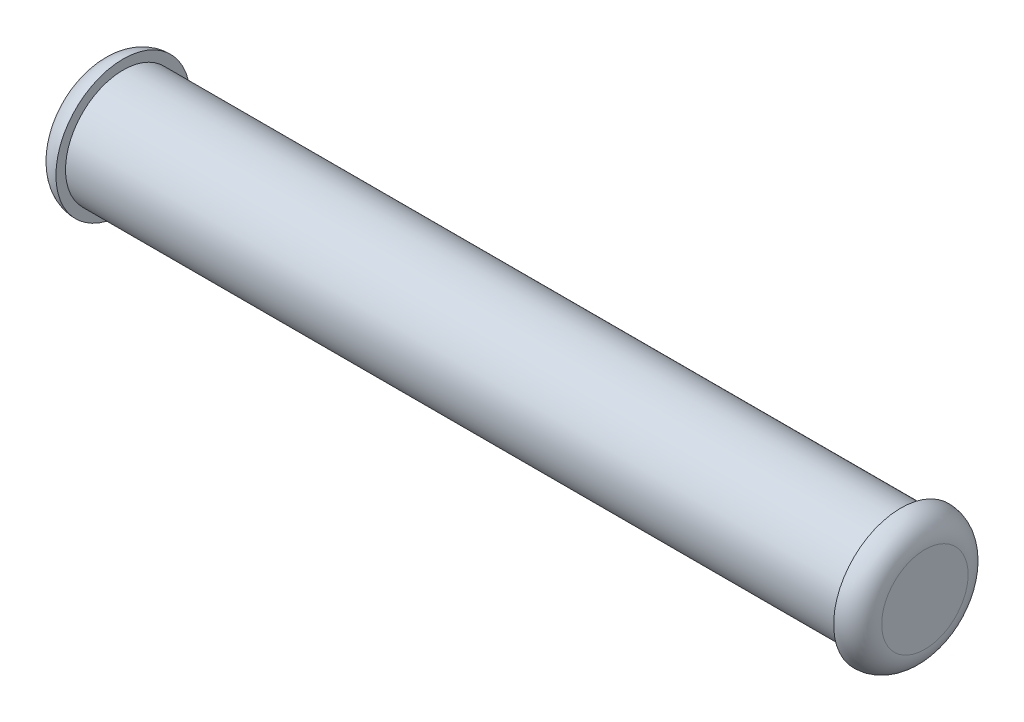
ISO-10303-21;
HEADER;
FILE_DESCRIPTION(('STEP AP214'),'2;1');
FILE_NAME('part.step','',(''),(''),'','','');
FILE_SCHEMA(('AUTOMOTIVE_DESIGN { 1 0 10303 214 1 1 1 1 }'));
ENDSEC;
DATA;
#1=APPLICATION_CONTEXT('core data for automotive mechanical design processes');
#2=APPLICATION_PROTOCOL_DEFINITION('international standard','automotive_design',2000,#1);
#3=PRODUCT_CONTEXT('',#1,'mechanical');
#4=PRODUCT('Part','Part','',(#3));
#5=PRODUCT_RELATED_PRODUCT_CATEGORY('part','',(#4));
#6=PRODUCT_DEFINITION_FORMATION('','',#4);
#7=PRODUCT_DEFINITION_CONTEXT('part definition',#1,'design');
#8=PRODUCT_DEFINITION('design','',#6,#7);
#9=PRODUCT_DEFINITION_SHAPE('','',#8);
#10=(LENGTH_UNIT() NAMED_UNIT(*) SI_UNIT(.MILLI.,.METRE.));
#11=(NAMED_UNIT(*) PLANE_ANGLE_UNIT() SI_UNIT($,.RADIAN.));
#12=(NAMED_UNIT(*) SI_UNIT($,.STERADIAN.) SOLID_ANGLE_UNIT());
#13=UNCERTAINTY_MEASURE_WITH_UNIT(LENGTH_MEASURE(1.E-05),#10,'distance_accuracy_value','');
#14=(GEOMETRIC_REPRESENTATION_CONTEXT(3) GLOBAL_UNCERTAINTY_ASSIGNED_CONTEXT((#13)) GLOBAL_UNIT_ASSIGNED_CONTEXT((#10,
#11,#12)) REPRESENTATION_CONTEXT('',''));
#15=CARTESIAN_POINT('',(0.,0.,0.));
#16=DIRECTION('',(0.,0.,1.));
#17=DIRECTION('',(1.,0.,0.));
#18=AXIS2_PLACEMENT_3D('',#15,#16,#17);
#19=CARTESIAN_POINT('',(16.2,0.,0.));
#20=DIRECTION('',(-1.,0.,0.));
#21=DIRECTION('',(0.,0.,1.));
#22=AXIS2_PLACEMENT_3D('',#19,#20,#21);
#23=CYLINDRICAL_SURFACE('',#22,2.4);
#24=CARTESIAN_POINT('',(16.2,0.,0.));
#25=DIRECTION('',(1.,0.,0.));
#26=DIRECTION('',(0.,0.,-1.));
#27=AXIS2_PLACEMENT_3D('',#24,#25,#26);
#28=CIRCLE('',#27,2.4);
#29=CARTESIAN_POINT('',(16.2,0.,-2.4));
#30=VERTEX_POINT('',#29);
#31=EDGE_CURVE('E46',#30,#30,#28,.T.);
#32=ORIENTED_EDGE('',*,*,#31,.F.);
#33=EDGE_LOOP('',(#32));
#34=FACE_BOUND('',#33,.T.);
#35=CARTESIAN_POINT('',(-16.2,0.,0.));
#36=DIRECTION('',(1.,0.,0.));
#37=DIRECTION('',(0.,0.,-1.));
#38=AXIS2_PLACEMENT_3D('',#35,#36,#37);
#39=CIRCLE('',#38,2.4);
#40=CARTESIAN_POINT('',(-16.2,0.,-2.4));
#41=VERTEX_POINT('',#40);
#42=EDGE_CURVE('E53',#41,#41,#39,.T.);
#43=ORIENTED_EDGE('',*,*,#42,.T.);
#44=EDGE_LOOP('',(#43));
#45=FACE_BOUND('',#44,.T.);
#46=ADVANCED_FACE('F35',(#34,#45),#23,.T.);
#47=CARTESIAN_POINT('',(17.2,0.,0.));
#48=DIRECTION('',(1.,0.,0.));
#49=DIRECTION('',(0.,0.,-1.));
#50=AXIS2_PLACEMENT_3D('',#47,#48,#49);
#51=PLANE('',#50);
#52=CARTESIAN_POINT('',(17.2,0.,0.));
#53=DIRECTION('',(1.,0.,0.));
#54=DIRECTION('',(0.,0.,-1.));
#55=AXIS2_PLACEMENT_3D('',#52,#53,#54);
#56=CIRCLE('',#55,1.8);
#57=CARTESIAN_POINT('',(17.2,0.,-1.8));
#58=VERTEX_POINT('',#57);
#59=EDGE_CURVE('E10',#58,#58,#56,.T.);
#60=ORIENTED_EDGE('',*,*,#59,.T.);
#61=EDGE_LOOP('',(#60));
#62=FACE_BOUND('',#61,.T.);
#63=ADVANCED_FACE('F77',(#62),#51,.T.);
#64=CARTESIAN_POINT('',(16.2,0.,0.));
#65=DIRECTION('',(1.,0.,0.));
#66=DIRECTION('',(0.,0.,-1.));
#67=AXIS2_PLACEMENT_3D('',#64,#65,#66);
#68=PLANE('',#67);
#69=ORIENTED_EDGE('',*,*,#31,.T.);
#70=EDGE_LOOP('',(#69));
#71=FACE_BOUND('',#70,.T.);
#72=CARTESIAN_POINT('',(16.2,0.,0.));
#73=DIRECTION('',(1.,0.,0.));
#74=DIRECTION('',(0.,0.,-1.));
#75=AXIS2_PLACEMENT_3D('',#72,#73,#74);
#76=CIRCLE('',#75,2.8);
#77=CARTESIAN_POINT('',(16.2,0.,-2.8));
#78=VERTEX_POINT('',#77);
#79=EDGE_CURVE('E50',#78,#78,#76,.T.);
#80=ORIENTED_EDGE('',*,*,#79,.F.);
#81=EDGE_LOOP('',(#80));
#82=FACE_BOUND('',#81,.T.);
#83=ADVANCED_FACE('F82',(#71,#82),#68,.F.);
#84=CARTESIAN_POINT('',(-17.2,0.,0.));
#85=DIRECTION('',(-1.,0.,0.));
#86=DIRECTION('',(0.,0.,-1.));
#87=AXIS2_PLACEMENT_3D('',#84,#85,#86);
#88=PLANE('',#87);
#89=CARTESIAN_POINT('',(-17.2,0.,0.));
#90=DIRECTION('',(-1.,0.,0.));
#91=DIRECTION('',(0.,0.,1.));
#92=AXIS2_PLACEMENT_3D('',#89,#90,#91);
#93=CIRCLE('',#92,1.8);
#94=CARTESIAN_POINT('',(-17.2,0.,1.8));
#95=VERTEX_POINT('',#94);
#96=EDGE_CURVE('E42',#95,#95,#93,.T.);
#97=ORIENTED_EDGE('',*,*,#96,.T.);
#98=EDGE_LOOP('',(#97));
#99=FACE_BOUND('',#98,.T.);
#100=ADVANCED_FACE('F72',(#99),#88,.T.);
#101=CARTESIAN_POINT('',(-16.2,0.,0.));
#102=DIRECTION('',(-1.,0.,0.));
#103=DIRECTION('',(0.,0.,-1.));
#104=AXIS2_PLACEMENT_3D('',#101,#102,#103);
#105=PLANE('',#104);
#106=ORIENTED_EDGE('',*,*,#42,.F.);
#107=EDGE_LOOP('',(#106));
#108=FACE_BOUND('',#107,.T.);
#109=CARTESIAN_POINT('',(-16.2,0.,0.));
#110=DIRECTION('',(1.,0.,0.));
#111=DIRECTION('',(0.,0.,-1.));
#112=AXIS2_PLACEMENT_3D('',#109,#110,#111);
#113=CIRCLE('',#112,2.8);
#114=CARTESIAN_POINT('',(-16.2,0.,-2.8));
#115=VERTEX_POINT('',#114);
#116=EDGE_CURVE('E55',#115,#115,#113,.T.);
#117=ORIENTED_EDGE('',*,*,#116,.T.);
#118=EDGE_LOOP('',(#117));
#119=FACE_BOUND('',#118,.T.);
#120=ADVANCED_FACE('F62',(#108,#119),#105,.F.);
#121=CARTESIAN_POINT('',(-16.2,0.,0.));
#122=DIRECTION('',(-1.,0.,0.));
#123=DIRECTION('',(0.,0.,1.));
#124=AXIS2_PLACEMENT_3D('',#121,#122,#123);
#125=TOROIDAL_SURFACE('',#124,1.8,1.);
#126=ORIENTED_EDGE('',*,*,#96,.F.);
#127=EDGE_LOOP('',(#126));
#128=FACE_BOUND('',#127,.T.);
#129=ORIENTED_EDGE('',*,*,#116,.F.);
#130=EDGE_LOOP('',(#129));
#131=FACE_BOUND('',#130,.T.);
#132=ADVANCED_FACE('F64',(#128,#131),#125,.T.);
#133=CARTESIAN_POINT('',(16.2,0.,0.));
#134=DIRECTION('',(1.,0.,0.));
#135=DIRECTION('',(0.,0.,-1.));
#136=AXIS2_PLACEMENT_3D('',#133,#134,#135);
#137=TOROIDAL_SURFACE('',#136,1.8,1.);
#138=ORIENTED_EDGE('',*,*,#79,.T.);
#139=EDGE_LOOP('',(#138));
#140=FACE_BOUND('',#139,.T.);
#141=ORIENTED_EDGE('',*,*,#59,.F.);
#142=EDGE_LOOP('',(#141));
#143=FACE_BOUND('',#142,.T.);
#144=ADVANCED_FACE('F37',(#140,#143),#137,.T.);
#145=CLOSED_SHELL('',(#46,#63,#83,#100,#120,#132,#144));
#146=MANIFOLD_SOLID_BREP('B2',#145);
#147=ADVANCED_BREP_SHAPE_REPRESENTATION('',(#18,#146),#14);
#148=SHAPE_DEFINITION_REPRESENTATION(#9,#147);
ENDSEC;
END-ISO-10303-21;
